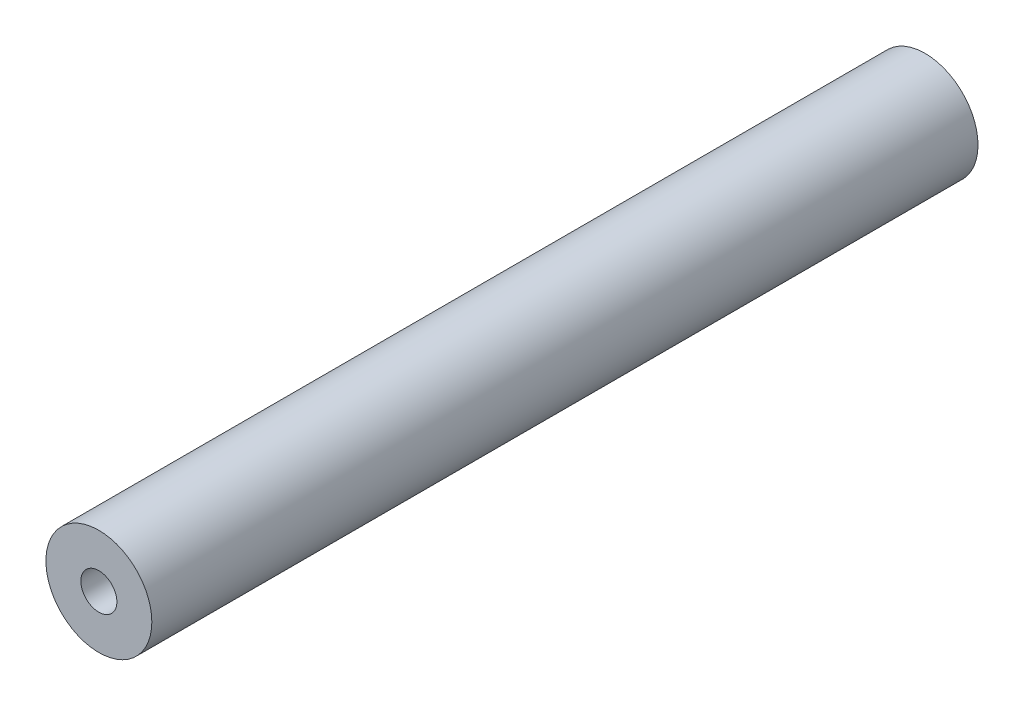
from build123d import *

# Parameters (mm, degrees)
ESQUISSE1_R             = 12.5
BASE_EXTRUSION_DEPTH    = 195
ESQUISSE2_R             = 4.25
ENL_V_MAT_EXTRU_1_DEPTH = 20
ENL_V_START             = -20
ESQUISSE3_R             = 4.25
ENL_V_MAT_EXTRU_3_DEPTH = 20


with BuildPart() as part:
    # Esquisse1 → Base-Extrusion (new body)
    with BuildSketch(Plane.XY):
        Circle(ESQUISSE1_R)
    extrude(amount=BASE_EXTRUSION_DEPTH)

    # Esquisse2 → Enl_v. mat.-Extru.1 (cut)
    with BuildSketch(Plane.XY.offset(195)):
        Circle(ESQUISSE2_R)
    extrude(amount=-ENL_V_MAT_EXTRU_1_DEPTH, mode=Mode.SUBTRACT)

    # Esquisse3 → Enl_v. mat.-Extru.3 (cut)
    with BuildSketch(Plane(origin=(0, 0, 0), x_dir=(-1, 0, 0), z_dir=(0, 0, -1)).offset(ENL_V_START)):
        with Locations(Location((0, 0, 0), (0, 0, 180))):
            Circle(ESQUISSE3_R)
    extrude(amount=ENL_V_MAT_EXTRU_3_DEPTH, mode=Mode.SUBTRACT)


solid = part.part
